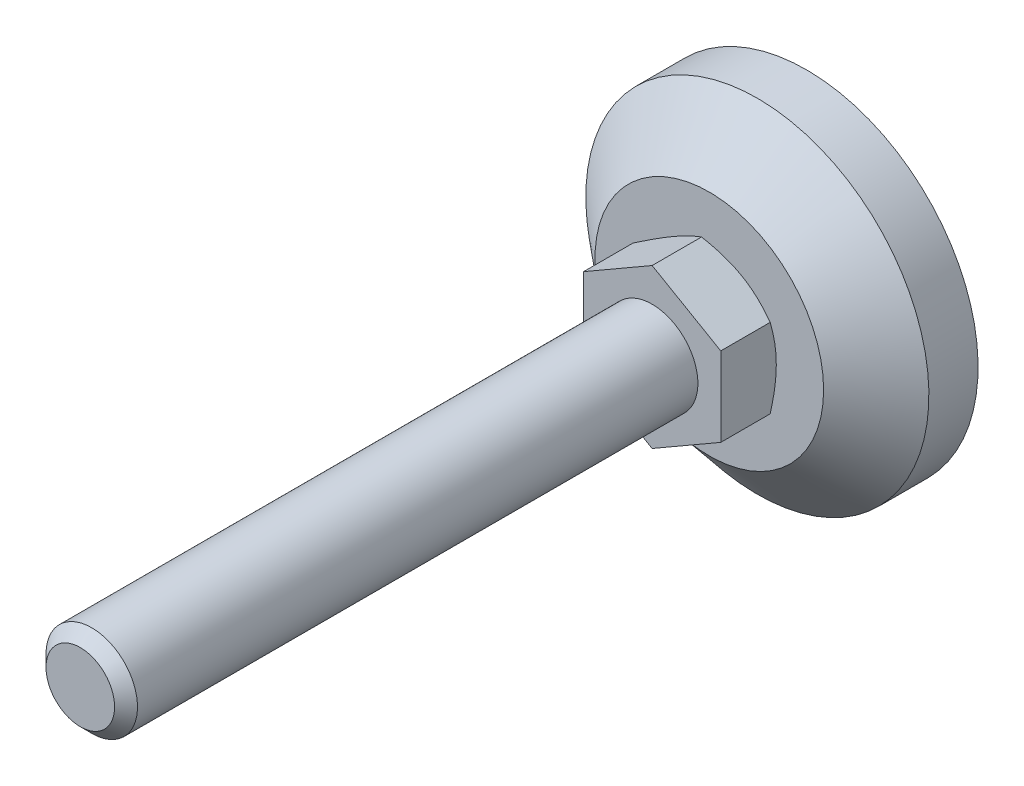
ISO-10303-21;
HEADER;
FILE_DESCRIPTION(('STEP AP214'),'2;1');
FILE_NAME('part.step','',(''),(''),'','','');
FILE_SCHEMA(('AUTOMOTIVE_DESIGN { 1 0 10303 214 1 1 1 1 }'));
ENDSEC;
DATA;
#1=APPLICATION_CONTEXT('core data for automotive mechanical design processes');
#2=APPLICATION_PROTOCOL_DEFINITION('international standard','automotive_design',2000,#1);
#3=PRODUCT_CONTEXT('',#1,'mechanical');
#4=PRODUCT('Part','Part','',(#3));
#5=PRODUCT_RELATED_PRODUCT_CATEGORY('part','',(#4));
#6=PRODUCT_DEFINITION_FORMATION('','',#4);
#7=PRODUCT_DEFINITION_CONTEXT('part definition',#1,'design');
#8=PRODUCT_DEFINITION('design','',#6,#7);
#9=PRODUCT_DEFINITION_SHAPE('','',#8);
#10=(LENGTH_UNIT() NAMED_UNIT(*) SI_UNIT(.MILLI.,.METRE.));
#11=(NAMED_UNIT(*) PLANE_ANGLE_UNIT() SI_UNIT($,.RADIAN.));
#12=(NAMED_UNIT(*) SI_UNIT($,.STERADIAN.) SOLID_ANGLE_UNIT());
#13=UNCERTAINTY_MEASURE_WITH_UNIT(LENGTH_MEASURE(1.E-05),#10,'distance_accuracy_value','');
#14=(GEOMETRIC_REPRESENTATION_CONTEXT(3) GLOBAL_UNCERTAINTY_ASSIGNED_CONTEXT((#13)) GLOBAL_UNIT_ASSIGNED_CONTEXT((#10,
#11,#12)) REPRESENTATION_CONTEXT('',''));
#15=CARTESIAN_POINT('',(0.,0.,0.));
#16=DIRECTION('',(0.,0.,1.));
#17=DIRECTION('',(1.,0.,0.));
#18=AXIS2_PLACEMENT_3D('',#15,#16,#17);
#19=CARTESIAN_POINT('',(0.,0.,27.));
#20=DIRECTION('',(0.,0.,1.));
#21=DIRECTION('',(0.5,-0.866025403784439,0.));
#22=AXIS2_PLACEMENT_3D('',#19,#20,#21);
#23=PLANE('',#22);
#24=DIRECTION('',(0.,1.,0.));
#25=VECTOR('',#24,1.);
#26=CARTESIAN_POINT('',(12.,-6.92820323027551,27.));
#27=LINE('',#26,#25);
#28=CARTESIAN_POINT('',(12.,-6.92820323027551,27.));
#29=VERTEX_POINT('',#28);
#30=CARTESIAN_POINT('',(12.,6.92820323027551,27.));
#31=VERTEX_POINT('',#30);
#32=EDGE_CURVE('E197',#29,#31,#27,.T.);
#33=ORIENTED_EDGE('',*,*,#32,.T.);
#34=DIRECTION('',(-0.866025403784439,0.5,0.));
#35=VECTOR('',#34,1.);
#36=CARTESIAN_POINT('',(12.,6.92820323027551,27.));
#37=LINE('',#36,#35);
#38=CARTESIAN_POINT('',(0.,13.856406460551,27.));
#39=VERTEX_POINT('',#38);
#40=EDGE_CURVE('E320',#31,#39,#37,.T.);
#41=ORIENTED_EDGE('',*,*,#40,.T.);
#42=DIRECTION('',(-0.866025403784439,-0.5,0.));
#43=VECTOR('',#42,1.);
#44=CARTESIAN_POINT('',(0.,13.856406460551,27.));
#45=LINE('',#44,#43);
#46=CARTESIAN_POINT('',(-12.,6.92820323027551,27.));
#47=VERTEX_POINT('',#46);
#48=EDGE_CURVE('E319',#39,#47,#45,.T.);
#49=ORIENTED_EDGE('',*,*,#48,.T.);
#50=DIRECTION('',(0.,-1.,0.));
#51=VECTOR('',#50,1.);
#52=CARTESIAN_POINT('',(-12.,6.92820323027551,27.));
#53=LINE('',#52,#51);
#54=CARTESIAN_POINT('',(-12.,-6.92820323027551,27.));
#55=VERTEX_POINT('',#54);
#56=EDGE_CURVE('E324',#47,#55,#53,.T.);
#57=ORIENTED_EDGE('',*,*,#56,.T.);
#58=DIRECTION('',(0.866025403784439,-0.5,0.));
#59=VECTOR('',#58,1.);
#60=CARTESIAN_POINT('',(-12.,-6.92820323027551,27.));
#61=LINE('',#60,#59);
#62=CARTESIAN_POINT('',(0.,-13.856406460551,27.));
#63=VERTEX_POINT('',#62);
#64=EDGE_CURVE('E326',#55,#63,#61,.T.);
#65=ORIENTED_EDGE('',*,*,#64,.T.);
#66=DIRECTION('',(0.866025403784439,0.5,0.));
#67=VECTOR('',#66,1.);
#68=CARTESIAN_POINT('',(0.,-13.856406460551,27.));
#69=LINE('',#68,#67);
#70=EDGE_CURVE('E37',#63,#29,#69,.T.);
#71=ORIENTED_EDGE('',*,*,#70,.T.);
#72=EDGE_LOOP('',(#33,#41,#49,#57,#65,#71));
#73=FACE_BOUND('',#72,.T.);
#74=CARTESIAN_POINT('',(0.,0.,27.));
#75=DIRECTION('',(0.,0.,1.));
#76=DIRECTION('',(0.5,-0.866025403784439,0.));
#77=AXIS2_PLACEMENT_3D('',#74,#75,#76);
#78=CIRCLE('',#77,8.);
#79=CARTESIAN_POINT('',(4.,-6.92820323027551,27.));
#80=VERTEX_POINT('',#79);
#81=EDGE_CURVE('E201',#80,#80,#78,.T.);
#82=ORIENTED_EDGE('',*,*,#81,.F.);
#83=EDGE_LOOP('',(#82));
#84=FACE_BOUND('',#83,.T.);
#85=ADVANCED_FACE('F14',(#73,#84),#23,.T.);
#86=CARTESIAN_POINT('',(-9.99463491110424,17.3112154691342,17.));
#87=DIRECTION('',(0.,0.,1.));
#88=DIRECTION('',(0.5,-0.866025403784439,0.));
#89=AXIS2_PLACEMENT_3D('',#86,#87,#88);
#90=PLANE('',#89);
#91=CARTESIAN_POINT('',(0.,0.,17.));
#92=DIRECTION('',(0.,0.,-1.));
#93=DIRECTION('',(-0.5,0.866025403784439,0.));
#94=AXIS2_PLACEMENT_3D('',#91,#92,#93);
#95=CIRCLE('',#94,19.9892698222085);
#96=CARTESIAN_POINT('',(-9.99463491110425,17.3112154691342,17.));
#97=VERTEX_POINT('',#96);
#98=EDGE_CURVE('E102',#97,#97,#95,.T.);
#99=ORIENTED_EDGE('',*,*,#98,.F.);
#100=EDGE_LOOP('',(#99));
#101=FACE_BOUND('',#100,.T.);
#102=CARTESIAN_POINT('',(0.,0.,17.));
#103=DIRECTION('',(0.,0.,-1.));
#104=DIRECTION('',(-0.5,0.866025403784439,0.));
#105=AXIS2_PLACEMENT_3D('',#102,#103,#104);
#106=CIRCLE('',#105,11.5);
#107=CARTESIAN_POINT('',(-5.75,9.95929214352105,17.));
#108=VERTEX_POINT('',#107);
#109=EDGE_CURVE('E84',#108,#108,#106,.T.);
#110=ORIENTED_EDGE('',*,*,#109,.T.);
#111=EDGE_LOOP('',(#110));
#112=FACE_BOUND('',#111,.T.);
#113=ADVANCED_FACE('F174',(#101,#112),#90,.T.);
#114=CARTESIAN_POINT('',(0.,0.,0.));
#115=DIRECTION('',(0.,0.,-1.));
#116=DIRECTION('',(-0.5,0.866025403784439,0.));
#117=AXIS2_PLACEMENT_3D('',#114,#115,#116);
#118=PLANE('',#117);
#119=CARTESIAN_POINT('',(0.,0.,0.));
#120=DIRECTION('',(0.,0.,-1.));
#121=DIRECTION('',(-0.5,0.866025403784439,0.));
#122=AXIS2_PLACEMENT_3D('',#119,#120,#121);
#123=CIRCLE('',#122,30.);
#124=CARTESIAN_POINT('',(-15.,25.9807621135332,0.));
#125=VERTEX_POINT('',#124);
#126=EDGE_CURVE('E73',#125,#125,#123,.T.);
#127=ORIENTED_EDGE('',*,*,#126,.T.);
#128=EDGE_LOOP('',(#127));
#129=FACE_BOUND('',#128,.T.);
#130=ADVANCED_FACE('F177',(#129),#118,.T.);
#131=CARTESIAN_POINT('',(0.,0.,-75.4972525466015));
#132=DIRECTION('',(0.,0.,-1.));
#133=DIRECTION('',(-0.5,0.866025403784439,0.));
#134=AXIS2_PLACEMENT_3D('',#131,#132,#133);
#135=CYLINDRICAL_SURFACE('',#134,30.);
#136=CARTESIAN_POINT('',(0.,0.,8.6));
#137=DIRECTION('',(0.,0.,-1.));
#138=DIRECTION('',(-0.5,0.866025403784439,0.));
#139=AXIS2_PLACEMENT_3D('',#136,#137,#138);
#140=CIRCLE('',#139,30.);
#141=CARTESIAN_POINT('',(-15.,25.9807621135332,8.6));
#142=VERTEX_POINT('',#141);
#143=EDGE_CURVE('E105',#142,#142,#140,.T.);
#144=ORIENTED_EDGE('',*,*,#143,.T.);
#145=EDGE_LOOP('',(#144));
#146=FACE_BOUND('',#145,.T.);
#147=ORIENTED_EDGE('',*,*,#126,.F.);
#148=EDGE_LOOP('',(#147));
#149=FACE_BOUND('',#148,.T.);
#150=ADVANCED_FACE('F181',(#146,#149),#135,.T.);
#151=CARTESIAN_POINT('',(0.,0.,8.6));
#152=DIRECTION('',(0.,0.,-1.));
#153=DIRECTION('',(-0.5,0.866025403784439,0.));
#154=AXIS2_PLACEMENT_3D('',#151,#152,#153);
#155=CONICAL_SURFACE('',#154,30.,0.872664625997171);
#156=ORIENTED_EDGE('',*,*,#98,.T.);
#157=EDGE_LOOP('',(#156));
#158=FACE_BOUND('',#157,.T.);
#159=ORIENTED_EDGE('',*,*,#143,.F.);
#160=EDGE_LOOP('',(#159));
#161=FACE_BOUND('',#160,.T.);
#162=ADVANCED_FACE('F121',(#158,#161),#155,.T.);
#163=CARTESIAN_POINT('',(0.,0.,20.8975219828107));
#164=DIRECTION('',(0.,0.,1.));
#165=DIRECTION('',(0.5,-0.866025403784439,0.));
#166=AXIS2_PLACEMENT_3D('',#163,#164,#165);
#167=CONICAL_SURFACE('',#166,18.2507060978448,1.0471975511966);
#168=ORIENTED_EDGE('',*,*,#109,.F.);
#169=EDGE_LOOP('',(#168));
#170=FACE_BOUND('',#169,.T.);
#171=CARTESIAN_POINT('',(-10.1845483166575,-19.7364581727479,23.1830146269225));
#172=CARTESIAN_POINT('',(-9.95731802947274,-19.6052667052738,23.0555465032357));
#173=CARTESIAN_POINT('',(-9.72982292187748,-19.4739223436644,22.9287081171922));
#174=CARTESIAN_POINT('',(-9.27424782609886,-19.2108959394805,22.6764332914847));
#175=CARTESIAN_POINT('',(-9.04616783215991,-19.0792138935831,22.5509968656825));
#176=CARTESIAN_POINT('',(-8.360907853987,-18.6835788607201,22.1769716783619));
#177=CARTESIAN_POINT('',(-7.90277404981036,-18.4190751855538,21.930704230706));
#178=CARTESIAN_POINT('',(-6.98100239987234,-17.8868900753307,21.4445247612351));
#179=CARTESIAN_POINT('',(-6.51734820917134,-17.6191992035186,21.2046539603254));
#180=CARTESIAN_POINT('',(-5.58637620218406,-17.0817022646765,20.734620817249));
#181=CARTESIAN_POINT('',(-5.11905855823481,-16.8118962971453,20.5044580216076));
#182=CARTESIAN_POINT('',(-4.16467967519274,-16.2608853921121,20.0490896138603));
#183=CARTESIAN_POINT('',(-3.67747196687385,-15.9795958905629,19.82429119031));
#184=CARTESIAN_POINT('',(-2.69737824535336,-15.413738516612,19.3915182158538));
#185=CARTESIAN_POINT('',(-2.20449160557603,-15.1291702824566,19.1835455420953));
#186=CARTESIAN_POINT('',(-1.21317256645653,-14.5568319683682,18.7898295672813));
#187=CARTESIAN_POINT('',(-0.714753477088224,-14.2690695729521,18.6040419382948));
#188=CARTESIAN_POINT('',(0.289281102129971,-13.6893899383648,18.2605950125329));
#189=CARTESIAN_POINT('',(0.794894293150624,-13.3974740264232,18.1029269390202));
#190=CARTESIAN_POINT('',(1.55740346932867,-12.9572391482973,17.8936125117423));
#191=CARTESIAN_POINT('',(1.81154649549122,-12.8105096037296,17.82851512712));
#192=CARTESIAN_POINT('',(2.3215816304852,-12.5160406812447,17.7081511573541));
#193=CARTESIAN_POINT('',(2.57747370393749,-12.3683013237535,17.652884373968));
#194=CARTESIAN_POINT('',(3.09083535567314,-12.0719118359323,17.5531523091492));
#195=CARTESIAN_POINT('',(3.34830490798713,-11.9232617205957,17.5086868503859));
#196=CARTESIAN_POINT('',(3.86455433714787,-11.6252049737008,17.4314414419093));
#197=CARTESIAN_POINT('',(4.12333416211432,-11.4757983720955,17.3986610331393));
#198=CARTESIAN_POINT('',(4.63843364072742,-11.1784055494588,17.345852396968));
#199=CARTESIAN_POINT('',(4.89474072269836,-11.0304265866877,17.3256616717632));
#200=CARTESIAN_POINT('',(5.40786438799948,-10.7341745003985,17.2978182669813));
#201=CARTESIAN_POINT('',(5.66468096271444,-10.5859013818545,17.2901653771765));
#202=CARTESIAN_POINT('',(6.17836497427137,-10.2893257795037,17.287579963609));
#203=CARTESIAN_POINT('',(6.43523241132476,-10.1410232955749,17.2926474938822));
#204=CARTESIAN_POINT('',(6.94855188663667,-9.84465815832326,17.3153783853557));
#205=CARTESIAN_POINT('',(7.20500390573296,-9.69659551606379,17.3330423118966));
#206=CARTESIAN_POINT('',(7.81927447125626,-9.34194623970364,17.3900614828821));
#207=CARTESIAN_POINT('',(8.17669346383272,-9.13559028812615,17.4352607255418));
#208=CARTESIAN_POINT('',(8.88892563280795,-8.72438285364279,17.5476838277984));
#209=CARTESIAN_POINT('',(9.24373845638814,-8.51953157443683,17.6149106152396));
#210=CARTESIAN_POINT('',(9.95040329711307,-8.11153843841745,17.7689975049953));
#211=CARTESIAN_POINT('',(10.3022528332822,-7.90839801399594,17.8558726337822));
#212=CARTESIAN_POINT('',(11.0024455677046,-7.50414155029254,18.0466010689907));
#213=CARTESIAN_POINT('',(11.3507888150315,-7.30302548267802,18.1504541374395));
#214=CARTESIAN_POINT('',(12.0517118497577,-6.89834737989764,18.3750877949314));
#215=CARTESIAN_POINT('',(12.4042127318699,-6.69483090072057,18.4961943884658));
#216=CARTESIAN_POINT('',(13.1057427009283,-6.28980238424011,18.7510771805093));
#217=CARTESIAN_POINT('',(13.4547717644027,-6.08829036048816,18.8848534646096));
#218=CARTESIAN_POINT('',(14.1495287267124,-5.68717224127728,19.1629377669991));
#219=CARTESIAN_POINT('',(14.4952576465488,-5.48756555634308,19.3072424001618));
#220=CARTESIAN_POINT('',(15.1838410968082,-5.09001171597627,19.6046702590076));
#221=CARTESIAN_POINT('',(15.5266956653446,-4.89206453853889,19.7577933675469));
#222=CARTESIAN_POINT('',(16.3531119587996,-4.41493286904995,20.1371587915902));
#223=CARTESIAN_POINT('',(16.8353860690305,-4.13649178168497,20.3671360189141));
#224=CARTESIAN_POINT('',(17.7956874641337,-3.58206151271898,20.838658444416));
#225=CARTESIAN_POINT('',(18.2737144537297,-3.3060725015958,21.0802044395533));
#226=CARTESIAN_POINT('',(19.2263411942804,-2.75607319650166,21.572480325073));
#227=CARTESIAN_POINT('',(19.7009400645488,-2.48206341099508,21.8232124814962));
#228=CARTESIAN_POINT('',(20.647182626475,-1.93575001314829,22.3319518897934));
#229=CARTESIAN_POINT('',(21.1188263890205,-1.66344635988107,22.5899589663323));
#230=CARTESIAN_POINT('',(22.060219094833,-1.11993302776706,23.1121588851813));
#231=CARTESIAN_POINT('',(22.5299651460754,-0.848725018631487,23.3763586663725));
#232=CARTESIAN_POINT('',(23.4674052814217,-0.307493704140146,23.9095679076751));
#233=CARTESIAN_POINT('',(23.9350993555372,-0.037470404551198,24.1785773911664));
#234=CARTESIAN_POINT('',(24.8686924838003,0.50153983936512,24.7205226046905));
#235=CARTESIAN_POINT('',(25.3345917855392,0.770526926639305,24.9934577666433));
#236=CARTESIAN_POINT('',(26.2649273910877,1.30765643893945,25.5426344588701));
#237=CARTESIAN_POINT('',(26.7293636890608,1.57579886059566,25.8188760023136));
#238=CARTESIAN_POINT('',(28.0397530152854,2.33235249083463,26.6032315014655));
#239=CARTESIAN_POINT('',(28.8842584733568,2.81992794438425,27.1145698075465));
#240=CARTESIAN_POINT('',(30.5701660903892,3.79328716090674,28.1440983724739));
#241=CARTESIAN_POINT('',(31.4115681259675,4.27907085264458,28.6622889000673));
#242=CARTESIAN_POINT('',(33.0897202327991,5.24795242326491,29.7025139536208));
#243=CARTESIAN_POINT('',(33.9264767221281,5.73105400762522,30.2245346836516));
#244=CARTESIAN_POINT('',(35.1801565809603,6.45486641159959,31.0105887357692));
#245=CARTESIAN_POINT('',(35.5977953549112,6.69599027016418,31.2731029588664));
#246=CARTESIAN_POINT('',(36.4326440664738,7.17799039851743,31.7990373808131));
#247=CARTESIAN_POINT('',(36.8498540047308,7.41886666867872,32.0624575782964));
#248=CARTESIAN_POINT('',(37.2668741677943,7.65963337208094,32.3262778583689));
#249=B_SPLINE_CURVE_WITH_KNOTS('',3,(#171,#172,#173,#174,#175,#176,#177,#178,#179,#180,#181,
#182,#183,#184,#185,#186,#187,#188,#189,#190,#191,#192,#193,#194,#195,#196,#197,#198,#199,#200,
#201,#202,#203,#204,#205,#206,#207,#208,#209,#210,#211,#212,#213,#214,#215,#216,#217,#218,#219,
#220,#221,#222,#223,#224,#225,#226,#227,#228,#229,#230,#231,#232,#233,#234,#235,#236,#237,#238,
#239,#240,#241,#242,#243,#244,#245,#246,#247,#248),.UNSPECIFIED.,.F.,.F.,(4,2,2,2,2,2,2,2,2,2,2,
2,2,2,2,2,2,2,2,2,2,2,2,2,2,2,2,2,2,2,2,2,2,2,2,2,2,2,4),(0.,0.875119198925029,1.75024704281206,
3.50075771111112,5.26066680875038,7.02049360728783,8.8377767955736,10.6552624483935,
12.469053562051,14.2822775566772,15.1839173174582,16.085538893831,16.9871456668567,
17.8887170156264,18.7783966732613,19.6680614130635,20.5577299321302,21.4474383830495,
22.6922901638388,23.9373074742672,25.1832801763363,26.4292354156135,27.7029922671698,
28.9767577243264,30.2501154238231,31.5234562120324,33.3307782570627,35.1382249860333,
36.9461206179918,38.7539727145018,40.5639577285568,42.3739515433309,44.1836860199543,
45.9934277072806,49.2966384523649,52.5999791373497,55.8945808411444,57.5417866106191,
59.1889898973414),.UNSPECIFIED.);
#250=CARTESIAN_POINT('',(0.,-13.856406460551,18.3604719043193));
#251=VERTEX_POINT('',#250);
#252=CARTESIAN_POINT('',(12.,-6.92820323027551,18.3604719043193));
#253=VERTEX_POINT('',#252);
#254=EDGE_CURVE('E65',#251,#253,#249,.T.);
#255=ORIENTED_EDGE('',*,*,#254,.F.);
#256=CARTESIAN_POINT('',(-12.0002,-6.92808776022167,18.3605385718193));
#257=CARTESIAN_POINT('',(-11.7364142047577,-7.08038456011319,18.2726247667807));
#258=CARTESIAN_POINT('',(-11.4716448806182,-7.2332492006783,18.1887011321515));
#259=CARTESIAN_POINT('',(-10.9399829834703,-7.54020434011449,18.0299413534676));
#260=CARTESIAN_POINT('',(-10.6730897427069,-7.69429522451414,17.9551081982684));
#261=CARTESIAN_POINT('',(-9.86810959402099,-8.15905073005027,17.7456926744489));
#262=CARTESIAN_POINT('',(-9.3268449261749,-8.47155003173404,17.6265783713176));
#263=CARTESIAN_POINT('',(-8.51686717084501,-8.93919090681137,17.4869061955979));
#264=CARTESIAN_POINT('',(-8.25057389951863,-9.09293539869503,17.4471189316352));
#265=CARTESIAN_POINT('',(-7.71675440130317,-9.40113622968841,17.3803985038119));
#266=CARTESIAN_POINT('',(-7.44922815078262,-9.55559258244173,17.3534655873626));
#267=CARTESIAN_POINT('',(-6.91372963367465,-9.86476279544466,17.3131437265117));
#268=CARTESIAN_POINT('',(-6.64575827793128,-10.0194761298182,17.2997386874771));
#269=CARTESIAN_POINT('',(-6.10956726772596,-10.3290461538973,17.286758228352));
#270=CARTESIAN_POINT('',(-5.84134762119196,-10.4839028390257,17.2871823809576));
#271=CARTESIAN_POINT('',(-5.33991062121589,-10.7734076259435,17.3008951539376));
#272=CARTESIAN_POINT('',(-5.10665750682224,-10.908076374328,17.3125111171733));
#273=CARTESIAN_POINT('',(-4.64068775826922,-11.1771041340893,17.3459831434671));
#274=CARTESIAN_POINT('',(-4.40797116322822,-11.3114631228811,17.367839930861));
#275=CARTESIAN_POINT('',(-3.94320092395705,-11.5797983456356,17.4214125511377));
#276=CARTESIAN_POINT('',(-3.71114798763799,-11.7137741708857,17.4531365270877));
#277=CARTESIAN_POINT('',(-3.24813003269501,-11.9810977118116,17.5258869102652));
#278=CARTESIAN_POINT('',(-3.01716508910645,-12.1144453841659,17.566913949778));
#279=CARTESIAN_POINT('',(-2.31605804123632,-12.5192297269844,17.7049867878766));
#280=CARTESIAN_POINT('',(-1.84794625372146,-12.789494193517,17.8158000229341));
#281=CARTESIAN_POINT('',(-0.918702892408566,-13.3259930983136,18.0673009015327));
#282=CARTESIAN_POINT('',(-0.457559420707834,-13.5922344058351,18.2079294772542));
#283=CARTESIAN_POINT('',(0.000200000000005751,-13.8565219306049,18.3605385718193));
#284=B_SPLINE_CURVE_WITH_KNOTS('',3,(#256,#257,#258,#259,#260,#261,#262,#263,#264,#265,#266,
#267,#268,#269,#270,#271,#272,#273,#274,#275,#276,#277,#278,#279,#280,#281,#282,#283),
.UNSPECIFIED.,.F.,.F.,(4,2,2,2,2,2,2,2,2,2,2,2,2,4),(0.,0.951004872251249,1.90232158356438,
3.80900466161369,4.73894551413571,5.6689042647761,6.59775529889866,7.52657763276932,
8.3351464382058,9.14377244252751,9.95306755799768,10.7624176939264,12.4167102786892,
14.0677556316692),.UNSPECIFIED.);
#285=CARTESIAN_POINT('',(-12.,-6.92820323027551,18.3604719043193));
#286=VERTEX_POINT('',#285);
#287=EDGE_CURVE('E68',#286,#251,#284,.T.);
#288=ORIENTED_EDGE('',*,*,#287,.F.);
#289=CARTESIAN_POINT('',(-12.,6.92843417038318,18.3605385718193));
#290=CARTESIAN_POINT('',(-12.,6.62384057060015,18.2726247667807));
#291=CARTESIAN_POINT('',(-12.,6.31811128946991,18.1887011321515));
#292=CARTESIAN_POINT('',(-12.,5.70420101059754,18.0299413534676));
#293=CARTESIAN_POINT('',(-12.,5.39601924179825,17.9551081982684));
#294=CARTESIAN_POINT('',(-12.,4.46650823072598,17.7456926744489));
#295=CARTESIAN_POINT('',(-12.,3.84150962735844,17.6265783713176));
#296=CARTESIAN_POINT('',(-12.,2.90622787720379,17.4869061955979));
#297=CARTESIAN_POINT('',(-12.,2.59873889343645,17.4471189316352));
#298=CARTESIAN_POINT('',(-12.,1.98233723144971,17.3803985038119));
#299=CARTESIAN_POINT('',(-12.,1.67342452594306,17.3534655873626));
#300=CARTESIAN_POINT('',(-12.,1.05508409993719,17.3131437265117));
#301=CARTESIAN_POINT('',(-12.,0.745657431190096,17.2997386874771));
#302=CARTESIAN_POINT('',(-12.,0.126517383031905,17.286758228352));
#303=CARTESIAN_POINT('',(-12.,-0.183195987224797,17.2871823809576));
#304=CARTESIAN_POINT('',(-12.,-0.76220556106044,17.3008951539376));
#305=CARTESIAN_POINT('',(-12.,-1.03154305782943,17.3125111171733));
#306=CARTESIAN_POINT('',(-12.,-1.56959857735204,17.3459831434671));
#307=CARTESIAN_POINT('',(-12.,-1.83831655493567,17.367839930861));
#308=CARTESIAN_POINT('',(-12.,-2.37498700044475,17.4214125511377));
#309=CARTESIAN_POINT('',(-12.,-2.64293865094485,17.4531365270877));
#310=CARTESIAN_POINT('',(-12.,-3.17758573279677,17.5258869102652));
#311=CARTESIAN_POINT('',(-12.,-3.44428107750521,17.566913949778));
#312=CARTESIAN_POINT('',(-12.,-4.25384976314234,17.7049867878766));
#313=CARTESIAN_POINT('',(-12.,-4.79437869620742,17.8158000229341));
#314=CARTESIAN_POINT('',(-12.,-5.86737650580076,18.0673009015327));
#315=CARTESIAN_POINT('',(-12.,-6.39985912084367,18.2079294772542));
#316=CARTESIAN_POINT('',(-12.,-6.92843417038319,18.3605385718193));
#317=B_SPLINE_CURVE_WITH_KNOTS('',3,(#289,#290,#291,#292,#293,#294,#295,#296,#297,#298,#299,
#300,#301,#302,#303,#304,#305,#306,#307,#308,#309,#310,#311,#312,#313,#314,#315,#316),
.UNSPECIFIED.,.F.,.F.,(4,2,2,2,2,2,2,2,2,2,2,2,2,4),(0.,0.951004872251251,1.90232158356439,
3.80900466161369,4.73894551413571,5.6689042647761,6.59775529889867,7.52657763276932,
8.3351464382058,9.14377244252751,9.95306755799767,10.7624176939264,12.4167102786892,
14.0677556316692),.UNSPECIFIED.);
#318=CARTESIAN_POINT('',(-12.,6.92820323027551,18.3604719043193));
#319=VERTEX_POINT('',#318);
#320=EDGE_CURVE('E83',#319,#286,#317,.T.);
#321=ORIENTED_EDGE('',*,*,#320,.F.);
#322=CARTESIAN_POINT('',(-22.184548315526,1.04815151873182,23.1830146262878));
#323=CARTESIAN_POINT('',(-21.9573180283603,1.179342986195,23.0555465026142));
#324=CARTESIAN_POINT('',(-21.729822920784,1.31068734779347,22.9287081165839));
#325=CARTESIAN_POINT('',(-21.2742478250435,1.57371375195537,22.676433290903));
#326=CARTESIAN_POINT('',(-21.0461678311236,1.7053957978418,22.550996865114));
#327=CARTESIAN_POINT('',(-20.3609078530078,2.1010308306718,22.1769716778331));
#328=CARTESIAN_POINT('',(-19.9027740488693,2.36553450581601,21.9307042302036));
#329=CARTESIAN_POINT('',(-18.9810023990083,2.89771961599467,21.4445247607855));
#330=CARTESIAN_POINT('',(-18.517348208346,3.16541048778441,21.2046539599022));
#331=CARTESIAN_POINT('',(-17.5863762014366,3.7029074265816,20.7346208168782));
#332=CARTESIAN_POINT('',(-17.1190585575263,3.97271339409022,20.5044580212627));
#333=CARTESIAN_POINT('',(-16.1646796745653,4.52372429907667,20.0490896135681));
#334=CARTESIAN_POINT('',(-15.6774719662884,4.80501380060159,19.8242911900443));
#335=CARTESIAN_POINT('',(-14.6973782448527,5.37087117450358,19.3915182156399));
#336=CARTESIAN_POINT('',(-14.2044916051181,5.65543940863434,19.1835455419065));
#337=CARTESIAN_POINT('',(-13.2131725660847,6.22777772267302,18.7898295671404));
#338=CARTESIAN_POINT('',(-12.7147534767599,6.51554011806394,18.6040419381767));
#339=CARTESIAN_POINT('',(-11.7107188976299,7.09521975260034,18.2605950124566));
#340=CARTESIAN_POINT('',(-11.2051057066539,7.38713566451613,18.1029269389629));
#341=CARTESIAN_POINT('',(-10.4425965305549,7.82737054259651,17.8936125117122));
#342=CARTESIAN_POINT('',(-10.1884535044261,7.97410008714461,17.8285151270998));
#343=CARTESIAN_POINT('',(-9.67841836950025,8.26856900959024,17.7081511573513));
#344=CARTESIAN_POINT('',(-9.42252629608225,8.41630836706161,17.6528843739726));
#345=CARTESIAN_POINT('',(-8.90916464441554,8.71269785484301,17.5531523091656));
#346=CARTESIAN_POINT('',(-8.6516950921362,8.86134797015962,17.5086868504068));
#347=CARTESIAN_POINT('',(-8.13544566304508,9.15940471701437,17.4314414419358));
#348=CARTESIAN_POINT('',(-7.87666583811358,9.30881131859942,17.3986610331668));
#349=CARTESIAN_POINT('',(-7.36156635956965,9.60620414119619,17.3458523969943));
#350=CARTESIAN_POINT('',(-7.10525927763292,9.75418310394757,17.3256616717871));
#351=CARTESIAN_POINT('',(-6.59213561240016,10.0504351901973,17.2978182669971));
#352=CARTESIAN_POINT('',(-6.33531903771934,10.1987083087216,17.2901653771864));
#353=CARTESIAN_POINT('',(-5.82163502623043,10.4952839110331,17.2875799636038));
#354=CARTESIAN_POINT('',(-5.56476758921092,10.6435863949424,17.2926474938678));
#355=CARTESIAN_POINT('',(-5.05144811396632,10.9399515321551,17.3153783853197));
#356=CARTESIAN_POINT('',(-4.79499609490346,11.0880141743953,17.3330423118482));
#357=CARTESIAN_POINT('',(-4.18072552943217,11.4426634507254,17.3900614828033));
#358=CARTESIAN_POINT('',(-3.82330653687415,11.6490194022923,17.4352607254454));
#359=CARTESIAN_POINT('',(-3.11107436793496,12.0602268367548,17.547683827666));
#360=CARTESIAN_POINT('',(-2.75626154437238,12.2650781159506,17.6149106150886));
#361=CARTESIAN_POINT('',(-2.04959670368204,12.67307125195,17.768997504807));
#362=CARTESIAN_POINT('',(-1.69774716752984,12.8762116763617,17.8558726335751));
#363=CARTESIAN_POINT('',(-0.997554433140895,13.2804681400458,18.0466010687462));
#364=CARTESIAN_POINT('',(-0.649211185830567,13.4815842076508,18.1504541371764));
#365=CARTESIAN_POINT('',(0.0517118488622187,13.8862623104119,18.3750877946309));
#366=CARTESIAN_POINT('',(0.404212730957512,14.0897787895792,18.4961943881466));
#367=CARTESIAN_POINT('',(1.10574269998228,14.4948073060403,18.7510771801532));
#368=CARTESIAN_POINT('',(1.45477176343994,14.6963193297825,18.8848534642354));
#369=CARTESIAN_POINT('',(2.1495287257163,15.0974374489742,19.1629377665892));
#370=CARTESIAN_POINT('',(2.49525764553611,15.2970441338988,19.3072423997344));
#371=CARTESIAN_POINT('',(3.18384109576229,15.6945979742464,19.6046702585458));
#372=CARTESIAN_POINT('',(3.52669566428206,15.8925451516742,19.7577933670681));
#373=CARTESIAN_POINT('',(4.3531119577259,16.3696768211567,20.1371587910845));
#374=CARTESIAN_POINT('',(4.83538606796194,16.6481179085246,20.3671360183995));
#375=CARTESIAN_POINT('',(5.7956874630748,17.2025481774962,20.838658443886));
#376=CARTESIAN_POINT('',(6.27371445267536,17.478537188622,21.0802044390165));
#377=CARTESIAN_POINT('',(7.22634119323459,18.0285364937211,21.5724803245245));
#378=CARTESIAN_POINT('',(7.7009400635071,18.30254627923,21.8232124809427));
#379=CARTESIAN_POINT('',(8.64718262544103,18.8488596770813,22.3319518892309));
#380=CARTESIAN_POINT('',(9.11882638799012,19.1211633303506,22.589958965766));
#381=CARTESIAN_POINT('',(10.0602190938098,19.6646766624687,23.1121588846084));
#382=CARTESIAN_POINT('',(10.5299651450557,19.9358846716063,23.3763586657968));
#383=CARTESIAN_POINT('',(11.4674052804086,20.4771159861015,23.9095679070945));
#384=CARTESIAN_POINT('',(11.9350993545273,20.7471392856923,24.1785773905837));
#385=CARTESIAN_POINT('',(12.8686924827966,21.2861495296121,24.7205226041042));
#386=CARTESIAN_POINT('',(13.3345917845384,21.555136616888,24.9934577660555));
#387=CARTESIAN_POINT('',(14.2649273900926,22.0922661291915,25.5426344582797));
#388=CARTESIAN_POINT('',(14.7293636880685,22.3604085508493,25.8188760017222));
#389=CARTESIAN_POINT('',(16.0397530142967,23.1169621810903,26.6032315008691));
#390=CARTESIAN_POINT('',(16.8842584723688,23.6045376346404,27.1145698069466));
#391=CARTESIAN_POINT('',(18.5701660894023,24.5778968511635,28.1440983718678));
#392=CARTESIAN_POINT('',(19.411568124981,25.0636805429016,28.6622888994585));
#393=CARTESIAN_POINT('',(21.0897202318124,26.0325621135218,29.7025139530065));
#394=CARTESIAN_POINT('',(21.9264767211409,26.5156636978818,30.2245346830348));
#395=CARTESIAN_POINT('',(23.1801565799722,27.2394761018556,31.0105887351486));
#396=CARTESIAN_POINT('',(23.5977953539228,27.48059996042,31.2731029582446));
#397=CARTESIAN_POINT('',(24.4326440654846,27.9626000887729,31.799037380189));
#398=CARTESIAN_POINT('',(24.8498540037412,28.2034763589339,32.0624575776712));
#399=CARTESIAN_POINT('',(25.2668741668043,28.4442430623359,32.3262778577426));
#400=B_SPLINE_CURVE_WITH_KNOTS('',3,(#322,#323,#324,#325,#326,#327,#328,#329,#330,#331,#332,
#333,#334,#335,#336,#337,#338,#339,#340,#341,#342,#343,#344,#345,#346,#347,#348,#349,#350,#351,
#352,#353,#354,#355,#356,#357,#358,#359,#360,#361,#362,#363,#364,#365,#366,#367,#368,#369,#370,
#371,#372,#373,#374,#375,#376,#377,#378,#379,#380,#381,#382,#383,#384,#385,#386,#387,#388,#389,
#390,#391,#392,#393,#394,#395,#396,#397,#398,#399),.UNSPECIFIED.,.F.,.F.,(4,2,2,2,2,2,2,2,2,2,2,
2,2,2,2,2,2,2,2,2,2,2,2,2,2,2,2,2,2,2,2,2,2,2,2,2,2,2,4),(0.,0.875119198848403,1.7502470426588,
3.50075771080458,5.2606668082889,7.02049360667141,8.83777679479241,10.6552624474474,
12.4690535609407,14.2822775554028,15.183917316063,16.085538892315,16.9871456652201,
17.8887170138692,18.7783966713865,19.668061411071,20.55772993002,21.4474383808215,
22.6922901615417,23.9373074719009,25.1832801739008,26.4292354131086,27.7029922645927,
28.9767577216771,30.2501154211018,31.523456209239,33.3307782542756,35.1382249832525,
36.9461206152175,38.7539727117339,40.5639577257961,42.3739515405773,44.1836860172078,
45.9934277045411,49.2966384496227,52.5999791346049,55.8945808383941,57.541786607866,
59.1889898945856),.UNSPECIFIED.);
#401=CARTESIAN_POINT('',(0.,13.856406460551,18.3604719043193));
#402=VERTEX_POINT('',#401);
#403=EDGE_CURVE('E143',#402,#319,#400,.F.);
#404=ORIENTED_EDGE('',*,*,#403,.F.);
#405=CARTESIAN_POINT('',(12.0002,6.92808776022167,18.3605385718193));
#406=CARTESIAN_POINT('',(11.7364142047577,7.08038456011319,18.2726247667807));
#407=CARTESIAN_POINT('',(11.4716448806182,7.2332492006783,18.1887011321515));
#408=CARTESIAN_POINT('',(10.9399829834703,7.54020434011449,18.0299413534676));
#409=CARTESIAN_POINT('',(10.6730897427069,7.69429522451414,17.9551081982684));
#410=CARTESIAN_POINT('',(9.86810959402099,8.15905073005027,17.7456926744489));
#411=CARTESIAN_POINT('',(9.3268449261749,8.47155003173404,17.6265783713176));
#412=CARTESIAN_POINT('',(8.51686717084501,8.93919090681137,17.4869061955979));
#413=CARTESIAN_POINT('',(8.25057389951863,9.09293539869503,17.4471189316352));
#414=CARTESIAN_POINT('',(7.71675440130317,9.40113622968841,17.3803985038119));
#415=CARTESIAN_POINT('',(7.44922815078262,9.55559258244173,17.3534655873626));
#416=CARTESIAN_POINT('',(6.91372963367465,9.86476279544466,17.3131437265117));
#417=CARTESIAN_POINT('',(6.64575827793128,10.0194761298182,17.2997386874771));
#418=CARTESIAN_POINT('',(6.10956726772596,10.3290461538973,17.286758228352));
#419=CARTESIAN_POINT('',(5.84134762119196,10.4839028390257,17.2871823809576));
#420=CARTESIAN_POINT('',(5.33991062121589,10.7734076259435,17.3008951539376));
#421=CARTESIAN_POINT('',(5.10665750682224,10.908076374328,17.3125111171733));
#422=CARTESIAN_POINT('',(4.64068775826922,11.1771041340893,17.3459831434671));
#423=CARTESIAN_POINT('',(4.40797116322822,11.3114631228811,17.367839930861));
#424=CARTESIAN_POINT('',(3.94320092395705,11.5797983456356,17.4214125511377));
#425=CARTESIAN_POINT('',(3.71114798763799,11.7137741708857,17.4531365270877));
#426=CARTESIAN_POINT('',(3.24813003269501,11.9810977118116,17.5258869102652));
#427=CARTESIAN_POINT('',(3.01716508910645,12.1144453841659,17.566913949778));
#428=CARTESIAN_POINT('',(2.31605804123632,12.5192297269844,17.7049867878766));
#429=CARTESIAN_POINT('',(1.84794625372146,12.789494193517,17.8158000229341));
#430=CARTESIAN_POINT('',(0.918702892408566,13.3259930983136,18.0673009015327));
#431=CARTESIAN_POINT('',(0.457559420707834,13.5922344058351,18.2079294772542));
#432=CARTESIAN_POINT('',(-0.000200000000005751,13.8565219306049,18.3605385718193));
#433=B_SPLINE_CURVE_WITH_KNOTS('',3,(#405,#406,#407,#408,#409,#410,#411,#412,#413,#414,#415,
#416,#417,#418,#419,#420,#421,#422,#423,#424,#425,#426,#427,#428,#429,#430,#431,#432),
.UNSPECIFIED.,.F.,.F.,(4,2,2,2,2,2,2,2,2,2,2,2,2,4),(0.,0.951004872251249,1.90232158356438,
3.80900466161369,4.73894551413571,5.6689042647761,6.59775529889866,7.52657763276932,
8.3351464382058,9.14377244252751,9.95306755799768,10.7624176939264,12.4167102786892,
14.0677556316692),.UNSPECIFIED.);
#434=CARTESIAN_POINT('',(12.,6.92820323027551,18.3604719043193));
#435=VERTEX_POINT('',#434);
#436=EDGE_CURVE('E150',#435,#402,#433,.T.);
#437=ORIENTED_EDGE('',*,*,#436,.F.);
#438=CARTESIAN_POINT('',(12.,-6.92843417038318,18.3605385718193));
#439=CARTESIAN_POINT('',(12.,-6.62384057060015,18.2726247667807));
#440=CARTESIAN_POINT('',(12.,-6.31811128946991,18.1887011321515));
#441=CARTESIAN_POINT('',(12.,-5.70420101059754,18.0299413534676));
#442=CARTESIAN_POINT('',(12.,-5.39601924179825,17.9551081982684));
#443=CARTESIAN_POINT('',(12.,-4.46650823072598,17.7456926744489));
#444=CARTESIAN_POINT('',(12.,-3.84150962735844,17.6265783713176));
#445=CARTESIAN_POINT('',(12.,-2.90622787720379,17.4869061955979));
#446=CARTESIAN_POINT('',(12.,-2.59873889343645,17.4471189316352));
#447=CARTESIAN_POINT('',(12.,-1.98233723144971,17.3803985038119));
#448=CARTESIAN_POINT('',(12.,-1.67342452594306,17.3534655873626));
#449=CARTESIAN_POINT('',(12.,-1.05508409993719,17.3131437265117));
#450=CARTESIAN_POINT('',(12.,-0.745657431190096,17.2997386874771));
#451=CARTESIAN_POINT('',(12.,-0.126517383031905,17.286758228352));
#452=CARTESIAN_POINT('',(12.,0.183195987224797,17.2871823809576));
#453=CARTESIAN_POINT('',(12.,0.76220556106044,17.3008951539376));
#454=CARTESIAN_POINT('',(12.,1.03154305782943,17.3125111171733));
#455=CARTESIAN_POINT('',(12.,1.56959857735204,17.3459831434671));
#456=CARTESIAN_POINT('',(12.,1.83831655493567,17.367839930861));
#457=CARTESIAN_POINT('',(12.,2.37498700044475,17.4214125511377));
#458=CARTESIAN_POINT('',(12.,2.64293865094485,17.4531365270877));
#459=CARTESIAN_POINT('',(12.,3.17758573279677,17.5258869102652));
#460=CARTESIAN_POINT('',(12.,3.44428107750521,17.566913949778));
#461=CARTESIAN_POINT('',(12.,4.25384976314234,17.7049867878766));
#462=CARTESIAN_POINT('',(12.,4.79437869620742,17.8158000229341));
#463=CARTESIAN_POINT('',(12.,5.86737650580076,18.0673009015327));
#464=CARTESIAN_POINT('',(12.,6.39985912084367,18.2079294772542));
#465=CARTESIAN_POINT('',(12.,6.92843417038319,18.3605385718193));
#466=B_SPLINE_CURVE_WITH_KNOTS('',3,(#438,#439,#440,#441,#442,#443,#444,#445,#446,#447,#448,
#449,#450,#451,#452,#453,#454,#455,#456,#457,#458,#459,#460,#461,#462,#463,#464,#465),
.UNSPECIFIED.,.F.,.F.,(4,2,2,2,2,2,2,2,2,2,2,2,2,4),(0.,0.951004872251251,1.90232158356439,
3.80900466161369,4.73894551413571,5.6689042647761,6.59775529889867,7.52657763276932,
8.3351464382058,9.14377244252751,9.95306755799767,10.7624176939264,12.4167102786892,
14.0677556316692),.UNSPECIFIED.);
#467=EDGE_CURVE('E29',#253,#435,#466,.T.);
#468=ORIENTED_EDGE('',*,*,#467,.F.);
#469=EDGE_LOOP('',(#255,#288,#321,#404,#437,#468));
#470=FACE_BOUND('',#469,.T.);
#471=ADVANCED_FACE('F67',(#170,#470),#167,.T.);
#472=CARTESIAN_POINT('',(0.,-13.856406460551,27.));
#473=DIRECTION('',(-0.5,0.866025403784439,0.));
#474=DIRECTION('',(-0.866025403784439,-0.5,0.));
#475=AXIS2_PLACEMENT_3D('',#472,#473,#474);
#476=PLANE('',#475);
#477=DIRECTION('',(0.,0.,-1.));
#478=VECTOR('',#477,1.);
#479=CARTESIAN_POINT('',(0.,-13.856406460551,27.));
#480=LINE('',#479,#478);
#481=EDGE_CURVE('E80',#63,#251,#480,.T.);
#482=ORIENTED_EDGE('',*,*,#481,.T.);
#483=ORIENTED_EDGE('',*,*,#254,.T.);
#484=DIRECTION('',(0.,0.,-1.));
#485=VECTOR('',#484,1.);
#486=CARTESIAN_POINT('',(12.,-6.92820323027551,27.));
#487=LINE('',#486,#485);
#488=EDGE_CURVE('E87',#29,#253,#487,.T.);
#489=ORIENTED_EDGE('',*,*,#488,.F.);
#490=ORIENTED_EDGE('',*,*,#70,.F.);
#491=EDGE_LOOP('',(#482,#483,#489,#490));
#492=FACE_BOUND('',#491,.T.);
#493=ADVANCED_FACE('F86',(#492),#476,.F.);
#494=CARTESIAN_POINT('',(-12.,-6.92820323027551,27.));
#495=DIRECTION('',(0.5,0.866025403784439,0.));
#496=DIRECTION('',(-0.866025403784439,0.5,0.));
#497=AXIS2_PLACEMENT_3D('',#494,#495,#496);
#498=PLANE('',#497);
#499=DIRECTION('',(0.,0.,-1.));
#500=VECTOR('',#499,1.);
#501=CARTESIAN_POINT('',(-12.,-6.92820323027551,27.));
#502=LINE('',#501,#500);
#503=EDGE_CURVE('E82',#55,#286,#502,.T.);
#504=ORIENTED_EDGE('',*,*,#503,.T.);
#505=ORIENTED_EDGE('',*,*,#287,.T.);
#506=ORIENTED_EDGE('',*,*,#481,.F.);
#507=ORIENTED_EDGE('',*,*,#64,.F.);
#508=EDGE_LOOP('',(#504,#505,#506,#507));
#509=FACE_BOUND('',#508,.T.);
#510=ADVANCED_FACE('F78',(#509),#498,.F.);
#511=CARTESIAN_POINT('',(-12.,6.92820323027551,27.));
#512=DIRECTION('',(1.,0.,0.));
#513=DIRECTION('',(0.,1.,0.));
#514=AXIS2_PLACEMENT_3D('',#511,#512,#513);
#515=PLANE('',#514);
#516=DIRECTION('',(0.,0.,-1.));
#517=VECTOR('',#516,1.);
#518=CARTESIAN_POINT('',(-12.,6.92820323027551,27.));
#519=LINE('',#518,#517);
#520=EDGE_CURVE('E89',#47,#319,#519,.T.);
#521=ORIENTED_EDGE('',*,*,#520,.T.);
#522=ORIENTED_EDGE('',*,*,#320,.T.);
#523=ORIENTED_EDGE('',*,*,#503,.F.);
#524=ORIENTED_EDGE('',*,*,#56,.F.);
#525=EDGE_LOOP('',(#521,#522,#523,#524));
#526=FACE_BOUND('',#525,.T.);
#527=ADVANCED_FACE('F297',(#526),#515,.F.);
#528=CARTESIAN_POINT('',(0.,13.856406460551,27.));
#529=DIRECTION('',(0.5,-0.866025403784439,0.));
#530=DIRECTION('',(0.866025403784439,0.5,0.));
#531=AXIS2_PLACEMENT_3D('',#528,#529,#530);
#532=PLANE('',#531);
#533=DIRECTION('',(0.,0.,-1.));
#534=VECTOR('',#533,1.);
#535=CARTESIAN_POINT('',(0.,13.856406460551,27.));
#536=LINE('',#535,#534);
#537=EDGE_CURVE('E96',#39,#402,#536,.T.);
#538=ORIENTED_EDGE('',*,*,#537,.T.);
#539=ORIENTED_EDGE('',*,*,#403,.T.);
#540=ORIENTED_EDGE('',*,*,#520,.F.);
#541=ORIENTED_EDGE('',*,*,#48,.F.);
#542=EDGE_LOOP('',(#538,#539,#540,#541));
#543=FACE_BOUND('',#542,.T.);
#544=ADVANCED_FACE('F167',(#543),#532,.F.);
#545=CARTESIAN_POINT('',(12.,6.92820323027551,27.));
#546=DIRECTION('',(-0.5,-0.866025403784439,0.));
#547=DIRECTION('',(0.866025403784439,-0.5,0.));
#548=AXIS2_PLACEMENT_3D('',#545,#546,#547);
#549=PLANE('',#548);
#550=DIRECTION('',(0.,0.,-1.));
#551=VECTOR('',#550,1.);
#552=CARTESIAN_POINT('',(12.,6.92820323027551,27.));
#553=LINE('',#552,#551);
#554=EDGE_CURVE('E99',#31,#435,#553,.T.);
#555=ORIENTED_EDGE('',*,*,#554,.T.);
#556=ORIENTED_EDGE('',*,*,#436,.T.);
#557=ORIENTED_EDGE('',*,*,#537,.F.);
#558=ORIENTED_EDGE('',*,*,#40,.F.);
#559=EDGE_LOOP('',(#555,#556,#557,#558));
#560=FACE_BOUND('',#559,.T.);
#561=ADVANCED_FACE('F163',(#560),#549,.F.);
#562=CARTESIAN_POINT('',(12.,-6.92820323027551,27.));
#563=DIRECTION('',(-1.,0.,0.));
#564=DIRECTION('',(0.,-1.,0.));
#565=AXIS2_PLACEMENT_3D('',#562,#563,#564);
#566=PLANE('',#565);
#567=ORIENTED_EDGE('',*,*,#488,.T.);
#568=ORIENTED_EDGE('',*,*,#467,.T.);
#569=ORIENTED_EDGE('',*,*,#554,.F.);
#570=ORIENTED_EDGE('',*,*,#32,.F.);
#571=EDGE_LOOP('',(#567,#568,#569,#570));
#572=FACE_BOUND('',#571,.T.);
#573=ADVANCED_FACE('F166',(#572),#566,.F.);
#574=CARTESIAN_POINT('',(0.,0.,127.));
#575=DIRECTION('',(0.,0.,-1.));
#576=DIRECTION('',(-0.5,0.866025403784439,0.));
#577=AXIS2_PLACEMENT_3D('',#574,#575,#576);
#578=CYLINDRICAL_SURFACE('',#577,8.);
#579=CARTESIAN_POINT('',(0.,0.,125.));
#580=DIRECTION('',(0.,0.,1.));
#581=DIRECTION('',(0.5,-0.866025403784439,0.));
#582=AXIS2_PLACEMENT_3D('',#579,#580,#581);
#583=CIRCLE('',#582,8.);
#584=CARTESIAN_POINT('',(4.,-6.92820323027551,125.));
#585=VERTEX_POINT('',#584);
#586=EDGE_CURVE('E9',#585,#585,#583,.F.);
#587=ORIENTED_EDGE('',*,*,#586,.T.);
#588=EDGE_LOOP('',(#587));
#589=FACE_BOUND('',#588,.T.);
#590=ORIENTED_EDGE('',*,*,#81,.T.);
#591=EDGE_LOOP('',(#590));
#592=FACE_BOUND('',#591,.T.);
#593=ADVANCED_FACE('F123',(#589,#592),#578,.T.);
#594=CARTESIAN_POINT('',(0.,0.,127.));
#595=DIRECTION('',(0.,0.,1.));
#596=DIRECTION('',(0.5,-0.866025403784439,0.));
#597=AXIS2_PLACEMENT_3D('',#594,#595,#596);
#598=PLANE('',#597);
#599=CARTESIAN_POINT('',(0.,0.,127.));
#600=DIRECTION('',(0.,0.,1.));
#601=DIRECTION('',(0.5,-0.866025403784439,0.));
#602=AXIS2_PLACEMENT_3D('',#599,#600,#601);
#603=CIRCLE('',#602,6.);
#604=CARTESIAN_POINT('',(3.,-5.19615242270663,127.));
#605=VERTEX_POINT('',#604);
#606=EDGE_CURVE('E22',#605,#605,#603,.T.);
#607=ORIENTED_EDGE('',*,*,#606,.T.);
#608=EDGE_LOOP('',(#607));
#609=FACE_BOUND('',#608,.T.);
#610=ADVANCED_FACE('F208',(#609),#598,.T.);
#611=CARTESIAN_POINT('',(0.,0.,127.));
#612=DIRECTION('',(0.,0.,-1.));
#613=DIRECTION('',(-0.5,0.866025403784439,0.));
#614=AXIS2_PLACEMENT_3D('',#611,#612,#613);
#615=CONICAL_SURFACE('',#614,6.,0.785398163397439);
#616=ORIENTED_EDGE('',*,*,#586,.F.);
#617=EDGE_LOOP('',(#616));
#618=FACE_BOUND('',#617,.T.);
#619=ORIENTED_EDGE('',*,*,#606,.F.);
#620=EDGE_LOOP('',(#619));
#621=FACE_BOUND('',#620,.T.);
#622=ADVANCED_FACE('F16',(#618,#621),#615,.T.);
#623=CLOSED_SHELL('',(#85,#113,#130,#150,#162,#471,#493,#510,#527,#544,#561,#573,#593,#610,#622));
#624=MANIFOLD_SOLID_BREP('B1',#623);
#625=ADVANCED_BREP_SHAPE_REPRESENTATION('',(#18,#624),#14);
#626=SHAPE_DEFINITION_REPRESENTATION(#9,#625);
ENDSEC;
END-ISO-10303-21;
